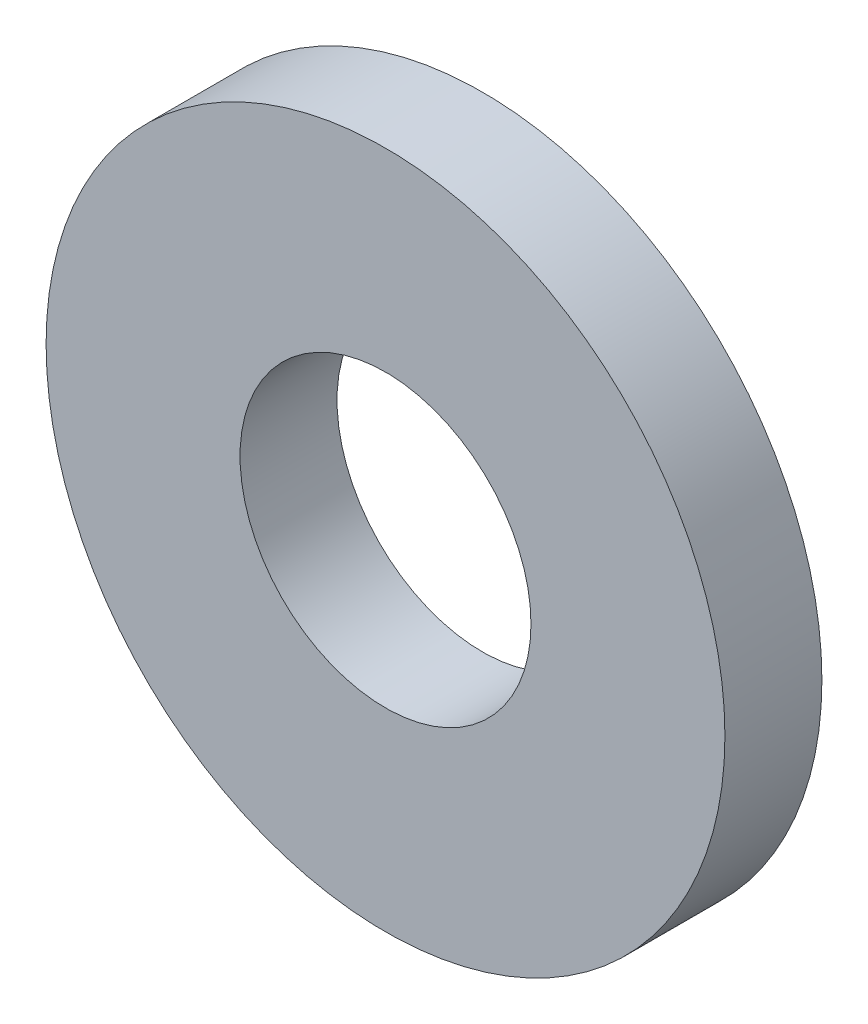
from build123d import *

# Parameters (mm, degrees)
ESQUISSE1_R      = 1.75
ESQUISSE1_R_2    = 0.75
EXTRUSION1_DEPTH = 0.5


with BuildPart() as part:
    # Esquisse1 → Extrusion1 (new body)
    with BuildSketch(Plane.XY):
        with Locations((11.35, -4)):
            Circle(ESQUISSE1_R)
        with Locations((11.35, -4)):
            Circle(ESQUISSE1_R_2, mode=Mode.SUBTRACT)
    extrude(amount=EXTRUSION1_DEPTH)


solid = part.part
